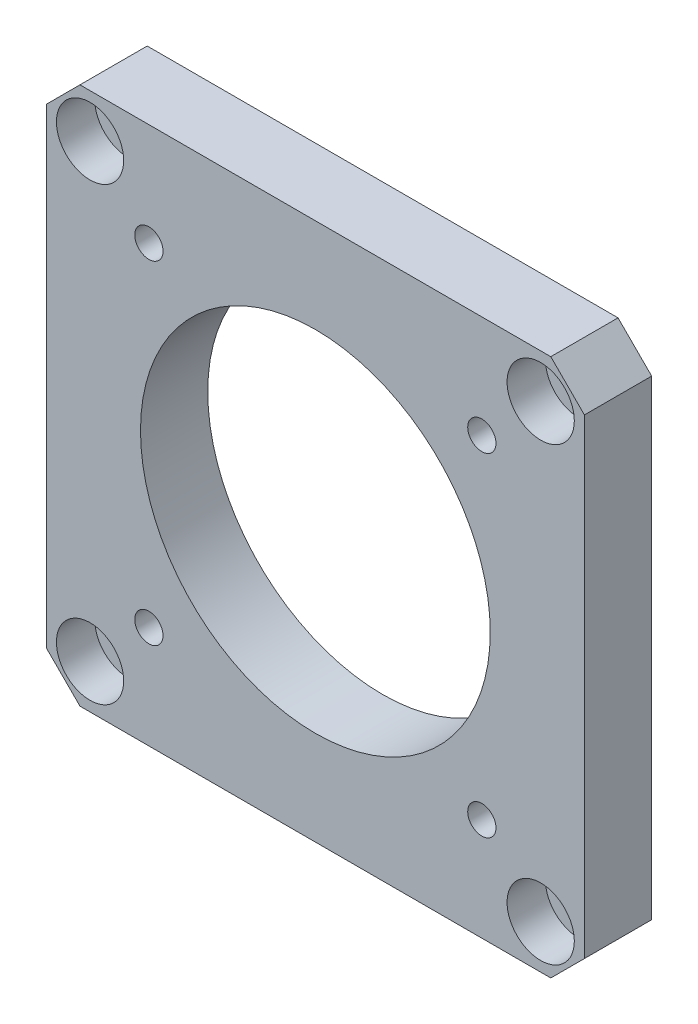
ISO-10303-21;
HEADER;
FILE_DESCRIPTION(('STEP AP214'),'2;1');
FILE_NAME('part.step','',(''),(''),'','','');
FILE_SCHEMA(('AUTOMOTIVE_DESIGN { 1 0 10303 214 1 1 1 1 }'));
ENDSEC;
DATA;
#1=APPLICATION_CONTEXT('core data for automotive mechanical design processes');
#2=APPLICATION_PROTOCOL_DEFINITION('international standard','automotive_design',2000,#1);
#3=PRODUCT_CONTEXT('',#1,'mechanical');
#4=PRODUCT('Part','Part','',(#3));
#5=PRODUCT_RELATED_PRODUCT_CATEGORY('part','',(#4));
#6=PRODUCT_DEFINITION_FORMATION('','',#4);
#7=PRODUCT_DEFINITION_CONTEXT('part definition',#1,'design');
#8=PRODUCT_DEFINITION('design','',#6,#7);
#9=PRODUCT_DEFINITION_SHAPE('','',#8);
#10=(LENGTH_UNIT() NAMED_UNIT(*) SI_UNIT(.MILLI.,.METRE.));
#11=(NAMED_UNIT(*) PLANE_ANGLE_UNIT() SI_UNIT($,.RADIAN.));
#12=(NAMED_UNIT(*) SI_UNIT($,.STERADIAN.) SOLID_ANGLE_UNIT());
#13=UNCERTAINTY_MEASURE_WITH_UNIT(LENGTH_MEASURE(1.E-05),#10,'distance_accuracy_value','');
#14=(GEOMETRIC_REPRESENTATION_CONTEXT(3) GLOBAL_UNCERTAINTY_ASSIGNED_CONTEXT((#13)) GLOBAL_UNIT_ASSIGNED_CONTEXT((#10,
#11,#12)) REPRESENTATION_CONTEXT('',''));
#15=CARTESIAN_POINT('',(0.,0.,0.));
#16=DIRECTION('',(0.,0.,1.));
#17=DIRECTION('',(1.,0.,0.));
#18=AXIS2_PLACEMENT_3D('',#15,#16,#17);
#19=CARTESIAN_POINT('',(-33.5,-33.5,10.));
#20=DIRECTION('',(0.,0.,1.));
#21=DIRECTION('',(1.,0.,0.));
#22=AXIS2_PLACEMENT_3D('',#19,#20,#21);
#23=CYLINDRICAL_SURFACE('',#22,2.75);
#24=CARTESIAN_POINT('',(-33.5,-33.5,4.3));
#25=DIRECTION('',(0.,0.,1.));
#26=DIRECTION('',(1.,0.,0.));
#27=AXIS2_PLACEMENT_3D('',#24,#25,#26);
#28=CIRCLE('',#27,2.75);
#29=CARTESIAN_POINT('',(-30.75,-33.5,4.3));
#30=VERTEX_POINT('',#29);
#31=EDGE_CURVE('E201',#30,#30,#28,.T.);
#32=ORIENTED_EDGE('',*,*,#31,.T.);
#33=EDGE_LOOP('',(#32));
#34=FACE_BOUND('',#33,.T.);
#35=CARTESIAN_POINT('',(-33.5,-33.5,1.));
#36=DIRECTION('',(0.,0.,-1.));
#37=DIRECTION('',(-1.,0.,0.));
#38=AXIS2_PLACEMENT_3D('',#35,#36,#37);
#39=CIRCLE('',#38,2.75);
#40=CARTESIAN_POINT('',(-36.25,-33.5,1.));
#41=VERTEX_POINT('',#40);
#42=EDGE_CURVE('E20',#41,#41,#39,.F.);
#43=ORIENTED_EDGE('',*,*,#42,.F.);
#44=EDGE_LOOP('',(#43));
#45=FACE_BOUND('',#44,.T.);
#46=ADVANCED_FACE('F16',(#34,#45),#23,.F.);
#47=CARTESIAN_POINT('',(33.5,-33.5,10.));
#48=DIRECTION('',(0.,0.,1.));
#49=DIRECTION('',(1.,0.,0.));
#50=AXIS2_PLACEMENT_3D('',#47,#48,#49);
#51=CYLINDRICAL_SURFACE('',#50,2.75);
#52=CARTESIAN_POINT('',(33.5,-33.5,4.3));
#53=DIRECTION('',(0.,0.,1.));
#54=DIRECTION('',(1.,0.,0.));
#55=AXIS2_PLACEMENT_3D('',#52,#53,#54);
#56=CIRCLE('',#55,2.75);
#57=CARTESIAN_POINT('',(36.25,-33.5,4.3));
#58=VERTEX_POINT('',#57);
#59=EDGE_CURVE('E210',#58,#58,#56,.T.);
#60=ORIENTED_EDGE('',*,*,#59,.T.);
#61=EDGE_LOOP('',(#60));
#62=FACE_BOUND('',#61,.T.);
#63=CARTESIAN_POINT('',(33.5,-33.5,1.));
#64=DIRECTION('',(0.,0.,-1.));
#65=DIRECTION('',(-1.,0.,0.));
#66=AXIS2_PLACEMENT_3D('',#63,#64,#65);
#67=CIRCLE('',#66,2.75);
#68=CARTESIAN_POINT('',(30.75,-33.5,1.));
#69=VERTEX_POINT('',#68);
#70=EDGE_CURVE('E153',#69,#69,#67,.F.);
#71=ORIENTED_EDGE('',*,*,#70,.F.);
#72=EDGE_LOOP('',(#71));
#73=FACE_BOUND('',#72,.T.);
#74=ADVANCED_FACE('F278',(#62,#73),#51,.F.);
#75=CARTESIAN_POINT('',(-33.5,33.5,10.));
#76=DIRECTION('',(0.,0.,1.));
#77=DIRECTION('',(1.,0.,0.));
#78=AXIS2_PLACEMENT_3D('',#75,#76,#77);
#79=CYLINDRICAL_SURFACE('',#78,2.75);
#80=CARTESIAN_POINT('',(-33.5,33.5,4.3));
#81=DIRECTION('',(0.,0.,1.));
#82=DIRECTION('',(1.,0.,0.));
#83=AXIS2_PLACEMENT_3D('',#80,#81,#82);
#84=CIRCLE('',#83,2.75);
#85=CARTESIAN_POINT('',(-30.75,33.5,4.3));
#86=VERTEX_POINT('',#85);
#87=EDGE_CURVE('E192',#86,#86,#84,.T.);
#88=ORIENTED_EDGE('',*,*,#87,.T.);
#89=EDGE_LOOP('',(#88));
#90=FACE_BOUND('',#89,.T.);
#91=CARTESIAN_POINT('',(-33.5,33.5,1.));
#92=DIRECTION('',(0.,0.,-1.));
#93=DIRECTION('',(-1.,0.,0.));
#94=AXIS2_PLACEMENT_3D('',#91,#92,#93);
#95=CIRCLE('',#94,2.75);
#96=CARTESIAN_POINT('',(-36.25,33.5,1.));
#97=VERTEX_POINT('',#96);
#98=EDGE_CURVE('E149',#97,#97,#95,.F.);
#99=ORIENTED_EDGE('',*,*,#98,.F.);
#100=EDGE_LOOP('',(#99));
#101=FACE_BOUND('',#100,.T.);
#102=ADVANCED_FACE('F285',(#90,#101),#79,.F.);
#103=CARTESIAN_POINT('',(33.5,33.5,10.));
#104=DIRECTION('',(0.,0.,1.));
#105=DIRECTION('',(1.,0.,0.));
#106=AXIS2_PLACEMENT_3D('',#103,#104,#105);
#107=CYLINDRICAL_SURFACE('',#106,2.75);
#108=CARTESIAN_POINT('',(33.5,33.5,4.3));
#109=DIRECTION('',(0.,0.,1.));
#110=DIRECTION('',(1.,0.,0.));
#111=AXIS2_PLACEMENT_3D('',#108,#109,#110);
#112=CIRCLE('',#111,2.75);
#113=CARTESIAN_POINT('',(36.25,33.5,4.3));
#114=VERTEX_POINT('',#113);
#115=EDGE_CURVE('E183',#114,#114,#112,.T.);
#116=ORIENTED_EDGE('',*,*,#115,.T.);
#117=EDGE_LOOP('',(#116));
#118=FACE_BOUND('',#117,.T.);
#119=CARTESIAN_POINT('',(33.5,33.5,1.));
#120=DIRECTION('',(0.,0.,-1.));
#121=DIRECTION('',(-1.,0.,0.));
#122=AXIS2_PLACEMENT_3D('',#119,#120,#121);
#123=CIRCLE('',#122,2.75);
#124=CARTESIAN_POINT('',(30.75,33.5,1.));
#125=VERTEX_POINT('',#124);
#126=EDGE_CURVE('E144',#125,#125,#123,.F.);
#127=ORIENTED_EDGE('',*,*,#126,.F.);
#128=EDGE_LOOP('',(#127));
#129=FACE_BOUND('',#128,.T.);
#130=ADVANCED_FACE('F335',(#118,#129),#107,.F.);
#131=CARTESIAN_POINT('',(-40.,40.,10.));
#132=DIRECTION('',(1.,0.,0.));
#133=DIRECTION('',(0.,1.,0.));
#134=AXIS2_PLACEMENT_3D('',#131,#132,#133);
#135=PLANE('',#134);
#136=DIRECTION('',(0.,-1.,0.));
#137=VECTOR('',#136,1.);
#138=CARTESIAN_POINT('',(-40.,40.,0.));
#139=LINE('',#138,#137);
#140=CARTESIAN_POINT('',(-40.,35.,0.));
#141=VERTEX_POINT('',#140);
#142=CARTESIAN_POINT('',(-40.,-35.,0.));
#143=VERTEX_POINT('',#142);
#144=EDGE_CURVE('E111',#141,#143,#139,.T.);
#145=ORIENTED_EDGE('',*,*,#144,.T.);
#146=DIRECTION('',(0.,0.,1.));
#147=VECTOR('',#146,1.);
#148=CARTESIAN_POINT('',(-40.,-35.,10.));
#149=LINE('',#148,#147);
#150=CARTESIAN_POINT('',(-40.,-35.,10.));
#151=VERTEX_POINT('',#150);
#152=EDGE_CURVE('E89',#143,#151,#149,.T.);
#153=ORIENTED_EDGE('',*,*,#152,.T.);
#154=DIRECTION('',(0.,-1.,0.));
#155=VECTOR('',#154,1.);
#156=CARTESIAN_POINT('',(-40.,40.,10.));
#157=LINE('',#156,#155);
#158=CARTESIAN_POINT('',(-40.,35.,10.));
#159=VERTEX_POINT('',#158);
#160=EDGE_CURVE('E121',#159,#151,#157,.T.);
#161=ORIENTED_EDGE('',*,*,#160,.F.);
#162=DIRECTION('',(0.,0.,-1.));
#163=VECTOR('',#162,1.);
#164=CARTESIAN_POINT('',(-40.,35.,10.));
#165=LINE('',#164,#163);
#166=EDGE_CURVE('E94',#159,#141,#165,.T.);
#167=ORIENTED_EDGE('',*,*,#166,.T.);
#168=EDGE_LOOP('',(#145,#153,#161,#167));
#169=FACE_BOUND('',#168,.T.);
#170=ADVANCED_FACE('F254',(#169),#135,.F.);
#171=CARTESIAN_POINT('',(40.,-40.,10.));
#172=DIRECTION('',(0.,1.,0.));
#173=DIRECTION('',(-1.,0.,0.));
#174=AXIS2_PLACEMENT_3D('',#171,#172,#173);
#175=PLANE('',#174);
#176=DIRECTION('',(1.,0.,0.));
#177=VECTOR('',#176,1.);
#178=CARTESIAN_POINT('',(40.,-40.,10.));
#179=LINE('',#178,#177);
#180=CARTESIAN_POINT('',(-35.,-40.,10.));
#181=VERTEX_POINT('',#180);
#182=CARTESIAN_POINT('',(35.,-40.,10.));
#183=VERTEX_POINT('',#182);
#184=EDGE_CURVE('E104',#181,#183,#179,.T.);
#185=ORIENTED_EDGE('',*,*,#184,.F.);
#186=DIRECTION('',(0.,0.,-1.));
#187=VECTOR('',#186,1.);
#188=CARTESIAN_POINT('',(-35.,-40.,10.));
#189=LINE('',#188,#187);
#190=CARTESIAN_POINT('',(-35.,-40.,0.));
#191=VERTEX_POINT('',#190);
#192=EDGE_CURVE('E88',#181,#191,#189,.T.);
#193=ORIENTED_EDGE('',*,*,#192,.T.);
#194=DIRECTION('',(1.,0.,0.));
#195=VECTOR('',#194,1.);
#196=CARTESIAN_POINT('',(40.,-40.,0.));
#197=LINE('',#196,#195);
#198=CARTESIAN_POINT('',(35.,-40.,0.));
#199=VERTEX_POINT('',#198);
#200=EDGE_CURVE('E101',#191,#199,#197,.T.);
#201=ORIENTED_EDGE('',*,*,#200,.T.);
#202=DIRECTION('',(0.,0.,1.));
#203=VECTOR('',#202,1.);
#204=CARTESIAN_POINT('',(35.,-40.,10.));
#205=LINE('',#204,#203);
#206=EDGE_CURVE('E106',#199,#183,#205,.T.);
#207=ORIENTED_EDGE('',*,*,#206,.T.);
#208=EDGE_LOOP('',(#185,#193,#201,#207));
#209=FACE_BOUND('',#208,.T.);
#210=ADVANCED_FACE('F100',(#209),#175,.F.);
#211=CARTESIAN_POINT('',(40.,40.,10.));
#212=DIRECTION('',(-1.,0.,0.));
#213=DIRECTION('',(0.,-1.,0.));
#214=AXIS2_PLACEMENT_3D('',#211,#212,#213);
#215=PLANE('',#214);
#216=DIRECTION('',(0.,1.,0.));
#217=VECTOR('',#216,1.);
#218=CARTESIAN_POINT('',(40.,40.,0.));
#219=LINE('',#218,#217);
#220=CARTESIAN_POINT('',(40.,-35.,0.));
#221=VERTEX_POINT('',#220);
#222=CARTESIAN_POINT('',(40.,35.,0.));
#223=VERTEX_POINT('',#222);
#224=EDGE_CURVE('E110',#221,#223,#219,.T.);
#225=ORIENTED_EDGE('',*,*,#224,.T.);
#226=DIRECTION('',(0.,0.,1.));
#227=VECTOR('',#226,1.);
#228=CARTESIAN_POINT('',(40.,35.,10.));
#229=LINE('',#228,#227);
#230=CARTESIAN_POINT('',(40.,35.,10.));
#231=VERTEX_POINT('',#230);
#232=EDGE_CURVE('E11',#223,#231,#229,.T.);
#233=ORIENTED_EDGE('',*,*,#232,.T.);
#234=DIRECTION('',(0.,1.,0.));
#235=VECTOR('',#234,1.);
#236=CARTESIAN_POINT('',(40.,40.,10.));
#237=LINE('',#236,#235);
#238=CARTESIAN_POINT('',(40.,-35.,10.));
#239=VERTEX_POINT('',#238);
#240=EDGE_CURVE('E245',#239,#231,#237,.T.);
#241=ORIENTED_EDGE('',*,*,#240,.F.);
#242=DIRECTION('',(0.,0.,-1.));
#243=VECTOR('',#242,1.);
#244=CARTESIAN_POINT('',(40.,-35.,10.));
#245=LINE('',#244,#243);
#246=EDGE_CURVE('E25',#239,#221,#245,.T.);
#247=ORIENTED_EDGE('',*,*,#246,.T.);
#248=EDGE_LOOP('',(#225,#233,#241,#247));
#249=FACE_BOUND('',#248,.T.);
#250=ADVANCED_FACE('F261',(#249),#215,.F.);
#251=CARTESIAN_POINT('',(40.,40.,10.));
#252=DIRECTION('',(0.,-1.,0.));
#253=DIRECTION('',(1.,0.,0.));
#254=AXIS2_PLACEMENT_3D('',#251,#252,#253);
#255=PLANE('',#254);
#256=DIRECTION('',(-1.,0.,0.));
#257=VECTOR('',#256,1.);
#258=CARTESIAN_POINT('',(40.,40.,0.));
#259=LINE('',#258,#257);
#260=CARTESIAN_POINT('',(35.,40.,0.));
#261=VERTEX_POINT('',#260);
#262=CARTESIAN_POINT('',(-35.,40.,0.));
#263=VERTEX_POINT('',#262);
#264=EDGE_CURVE('E114',#261,#263,#259,.T.);
#265=ORIENTED_EDGE('',*,*,#264,.T.);
#266=DIRECTION('',(0.,0.,1.));
#267=VECTOR('',#266,1.);
#268=CARTESIAN_POINT('',(-35.,40.,10.));
#269=LINE('',#268,#267);
#270=CARTESIAN_POINT('',(-35.,40.,10.));
#271=VERTEX_POINT('',#270);
#272=EDGE_CURVE('E33',#263,#271,#269,.T.);
#273=ORIENTED_EDGE('',*,*,#272,.T.);
#274=DIRECTION('',(-1.,0.,0.));
#275=VECTOR('',#274,1.);
#276=CARTESIAN_POINT('',(40.,40.,10.));
#277=LINE('',#276,#275);
#278=CARTESIAN_POINT('',(35.,40.,10.));
#279=VERTEX_POINT('',#278);
#280=EDGE_CURVE('E122',#279,#271,#277,.T.);
#281=ORIENTED_EDGE('',*,*,#280,.F.);
#282=DIRECTION('',(0.,0.,-1.));
#283=VECTOR('',#282,1.);
#284=CARTESIAN_POINT('',(35.,40.,10.));
#285=LINE('',#284,#283);
#286=EDGE_CURVE('E138',#279,#261,#285,.T.);
#287=ORIENTED_EDGE('',*,*,#286,.T.);
#288=EDGE_LOOP('',(#265,#273,#281,#287));
#289=FACE_BOUND('',#288,.T.);
#290=ADVANCED_FACE('F256',(#289),#255,.F.);
#291=CARTESIAN_POINT('',(0.,0.,10.));
#292=DIRECTION('',(0.,0.,-1.));
#293=DIRECTION('',(-1.,0.,0.));
#294=AXIS2_PLACEMENT_3D('',#291,#292,#293);
#295=PLANE('',#294);
#296=CARTESIAN_POINT('',(33.5,33.5,10.));
#297=DIRECTION('',(0.,0.,1.));
#298=DIRECTION('',(1.,0.,0.));
#299=AXIS2_PLACEMENT_3D('',#296,#297,#298);
#300=CIRCLE('',#299,5.);
#301=CARTESIAN_POINT('',(38.5,33.5,10.));
#302=VERTEX_POINT('',#301);
#303=EDGE_CURVE('E147',#302,#302,#300,.T.);
#304=ORIENTED_EDGE('',*,*,#303,.F.);
#305=EDGE_LOOP('',(#304));
#306=FACE_BOUND('',#305,.T.);
#307=CARTESIAN_POINT('',(-33.5,33.5,10.));
#308=DIRECTION('',(0.,0.,1.));
#309=DIRECTION('',(1.,0.,0.));
#310=AXIS2_PLACEMENT_3D('',#307,#308,#309);
#311=CIRCLE('',#310,5.);
#312=CARTESIAN_POINT('',(-28.5,33.5,10.));
#313=VERTEX_POINT('',#312);
#314=EDGE_CURVE('E186',#313,#313,#311,.T.);
#315=ORIENTED_EDGE('',*,*,#314,.F.);
#316=EDGE_LOOP('',(#315));
#317=FACE_BOUND('',#316,.T.);
#318=CARTESIAN_POINT('',(-33.5,-33.5,10.));
#319=DIRECTION('',(0.,0.,1.));
#320=DIRECTION('',(1.,0.,0.));
#321=AXIS2_PLACEMENT_3D('',#318,#319,#320);
#322=CIRCLE('',#321,5.);
#323=CARTESIAN_POINT('',(-28.5,-33.5,10.));
#324=VERTEX_POINT('',#323);
#325=EDGE_CURVE('E195',#324,#324,#322,.T.);
#326=ORIENTED_EDGE('',*,*,#325,.F.);
#327=EDGE_LOOP('',(#326));
#328=FACE_BOUND('',#327,.T.);
#329=CARTESIAN_POINT('',(33.5,-33.5,10.));
#330=DIRECTION('',(0.,0.,1.));
#331=DIRECTION('',(1.,0.,0.));
#332=AXIS2_PLACEMENT_3D('',#329,#330,#331);
#333=CIRCLE('',#332,5.);
#334=CARTESIAN_POINT('',(38.5,-33.5,10.));
#335=VERTEX_POINT('',#334);
#336=EDGE_CURVE('E204',#335,#335,#333,.T.);
#337=ORIENTED_EDGE('',*,*,#336,.F.);
#338=EDGE_LOOP('',(#337));
#339=FACE_BOUND('',#338,.T.);
#340=CARTESIAN_POINT('',(24.7487373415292,24.7487373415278,10.));
#341=DIRECTION('',(0.,0.,-1.));
#342=DIRECTION('',(-1.,0.,0.));
#343=AXIS2_PLACEMENT_3D('',#340,#341,#342);
#344=CIRCLE('',#343,2.1);
#345=CARTESIAN_POINT('',(22.6487373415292,24.7487373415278,10.));
#346=VERTEX_POINT('',#345);
#347=EDGE_CURVE('E216',#346,#346,#344,.T.);
#348=ORIENTED_EDGE('',*,*,#347,.T.);
#349=EDGE_LOOP('',(#348));
#350=FACE_BOUND('',#349,.T.);
#351=CARTESIAN_POINT('',(-24.7487373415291,24.7487373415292,10.));
#352=DIRECTION('',(0.,0.,-1.));
#353=DIRECTION('',(-1.,0.,0.));
#354=AXIS2_PLACEMENT_3D('',#351,#352,#353);
#355=CIRCLE('',#354,2.1);
#356=CARTESIAN_POINT('',(-26.8487373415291,24.7487373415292,10.));
#357=VERTEX_POINT('',#356);
#358=EDGE_CURVE('E222',#357,#357,#355,.T.);
#359=ORIENTED_EDGE('',*,*,#358,.T.);
#360=EDGE_LOOP('',(#359));
#361=FACE_BOUND('',#360,.T.);
#362=CARTESIAN_POINT('',(-24.7487373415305,-24.7487373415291,10.));
#363=DIRECTION('',(0.,0.,-1.));
#364=DIRECTION('',(-1.,0.,0.));
#365=AXIS2_PLACEMENT_3D('',#362,#363,#364);
#366=CIRCLE('',#365,2.1);
#367=CARTESIAN_POINT('',(-26.8487373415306,-24.7487373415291,10.));
#368=VERTEX_POINT('',#367);
#369=EDGE_CURVE('E228',#368,#368,#366,.T.);
#370=ORIENTED_EDGE('',*,*,#369,.T.);
#371=EDGE_LOOP('',(#370));
#372=FACE_BOUND('',#371,.T.);
#373=CARTESIAN_POINT('',(24.7487373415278,-24.7487373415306,10.));
#374=DIRECTION('',(0.,0.,-1.));
#375=DIRECTION('',(-1.,0.,0.));
#376=AXIS2_PLACEMENT_3D('',#373,#374,#375);
#377=CIRCLE('',#376,2.1);
#378=CARTESIAN_POINT('',(22.6487373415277,-24.7487373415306,10.));
#379=VERTEX_POINT('',#378);
#380=EDGE_CURVE('E234',#379,#379,#377,.T.);
#381=ORIENTED_EDGE('',*,*,#380,.T.);
#382=EDGE_LOOP('',(#381));
#383=FACE_BOUND('',#382,.T.);
#384=CARTESIAN_POINT('',(0.,0.,10.));
#385=DIRECTION('',(0.,0.,-1.));
#386=DIRECTION('',(-1.,0.,0.));
#387=AXIS2_PLACEMENT_3D('',#384,#385,#386);
#388=CIRCLE('',#387,26.);
#389=CARTESIAN_POINT('',(-26.,0.,10.));
#390=VERTEX_POINT('',#389);
#391=EDGE_CURVE('E116',#390,#390,#388,.T.);
#392=ORIENTED_EDGE('',*,*,#391,.T.);
#393=EDGE_LOOP('',(#392));
#394=FACE_BOUND('',#393,.T.);
#395=ORIENTED_EDGE('',*,*,#160,.T.);
#396=DIRECTION('',(-0.707106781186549,0.707106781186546,0.));
#397=VECTOR('',#396,1.);
#398=CARTESIAN_POINT('',(-35.,-40.,10.));
#399=LINE('',#398,#397);
#400=EDGE_CURVE('E136',#151,#181,#399,.F.);
#401=ORIENTED_EDGE('',*,*,#400,.T.);
#402=ORIENTED_EDGE('',*,*,#184,.T.);
#403=DIRECTION('',(-0.707106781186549,-0.707106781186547,0.));
#404=VECTOR('',#403,1.);
#405=CARTESIAN_POINT('',(40.,-35.,10.));
#406=LINE('',#405,#404);
#407=EDGE_CURVE('E131',#183,#239,#406,.F.);
#408=ORIENTED_EDGE('',*,*,#407,.T.);
#409=ORIENTED_EDGE('',*,*,#240,.T.);
#410=DIRECTION('',(0.707106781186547,-0.707106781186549,0.));
#411=VECTOR('',#410,1.);
#412=CARTESIAN_POINT('',(35.,40.,10.));
#413=LINE('',#412,#411);
#414=EDGE_CURVE('E40',#231,#279,#413,.F.);
#415=ORIENTED_EDGE('',*,*,#414,.T.);
#416=ORIENTED_EDGE('',*,*,#280,.T.);
#417=DIRECTION('',(0.707106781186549,0.707106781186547,0.));
#418=VECTOR('',#417,1.);
#419=CARTESIAN_POINT('',(-40.,35.,10.));
#420=LINE('',#419,#418);
#421=EDGE_CURVE('E134',#271,#159,#420,.F.);
#422=ORIENTED_EDGE('',*,*,#421,.T.);
#423=EDGE_LOOP('',(#395,#401,#402,#408,#409,#415,#416,#422));
#424=FACE_BOUND('',#423,.T.);
#425=ADVANCED_FACE('F247',(#306,#317,#328,#339,#350,#361,#372,#383,#394,#424),#295,.F.);
#426=CARTESIAN_POINT('',(0.,0.,0.));
#427=DIRECTION('',(0.,0.,-1.));
#428=DIRECTION('',(-1.,0.,0.));
#429=AXIS2_PLACEMENT_3D('',#426,#427,#428);
#430=PLANE('',#429);
#431=CARTESIAN_POINT('',(-33.5,-33.5,0.));
#432=DIRECTION('',(0.,0.,-1.));
#433=DIRECTION('',(-1.,0.,0.));
#434=AXIS2_PLACEMENT_3D('',#431,#432,#433);
#435=CIRCLE('',#434,5.);
#436=CARTESIAN_POINT('',(-38.5,-33.5,0.));
#437=VERTEX_POINT('',#436);
#438=EDGE_CURVE('E169',#437,#437,#435,.T.);
#439=ORIENTED_EDGE('',*,*,#438,.F.);
#440=EDGE_LOOP('',(#439));
#441=FACE_BOUND('',#440,.T.);
#442=CARTESIAN_POINT('',(33.5,-33.5,0.));
#443=DIRECTION('',(0.,0.,-1.));
#444=DIRECTION('',(-1.,0.,0.));
#445=AXIS2_PLACEMENT_3D('',#442,#443,#444);
#446=CIRCLE('',#445,5.);
#447=CARTESIAN_POINT('',(28.5,-33.5,0.));
#448=VERTEX_POINT('',#447);
#449=EDGE_CURVE('E162',#448,#448,#446,.T.);
#450=ORIENTED_EDGE('',*,*,#449,.F.);
#451=EDGE_LOOP('',(#450));
#452=FACE_BOUND('',#451,.T.);
#453=CARTESIAN_POINT('',(-33.5,33.5,0.));
#454=DIRECTION('',(0.,0.,-1.));
#455=DIRECTION('',(-1.,0.,0.));
#456=AXIS2_PLACEMENT_3D('',#453,#454,#455);
#457=CIRCLE('',#456,5.);
#458=CARTESIAN_POINT('',(-38.5,33.5,0.));
#459=VERTEX_POINT('',#458);
#460=EDGE_CURVE('E155',#459,#459,#457,.T.);
#461=ORIENTED_EDGE('',*,*,#460,.F.);
#462=EDGE_LOOP('',(#461));
#463=FACE_BOUND('',#462,.T.);
#464=CARTESIAN_POINT('',(33.5,33.5,0.));
#465=DIRECTION('',(0.,0.,-1.));
#466=DIRECTION('',(-1.,0.,0.));
#467=AXIS2_PLACEMENT_3D('',#464,#465,#466);
#468=CIRCLE('',#467,5.);
#469=CARTESIAN_POINT('',(28.5,33.5,0.));
#470=VERTEX_POINT('',#469);
#471=EDGE_CURVE('E151',#470,#470,#468,.T.);
#472=ORIENTED_EDGE('',*,*,#471,.F.);
#473=EDGE_LOOP('',(#472));
#474=FACE_BOUND('',#473,.T.);
#475=CARTESIAN_POINT('',(24.7487373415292,24.7487373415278,0.));
#476=DIRECTION('',(0.,0.,-1.));
#477=DIRECTION('',(-1.,0.,0.));
#478=AXIS2_PLACEMENT_3D('',#475,#476,#477);
#479=CIRCLE('',#478,2.1);
#480=CARTESIAN_POINT('',(22.6487373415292,24.7487373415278,0.));
#481=VERTEX_POINT('',#480);
#482=EDGE_CURVE('E213',#481,#481,#479,.T.);
#483=ORIENTED_EDGE('',*,*,#482,.F.);
#484=EDGE_LOOP('',(#483));
#485=FACE_BOUND('',#484,.T.);
#486=CARTESIAN_POINT('',(-24.7487373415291,24.7487373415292,0.));
#487=DIRECTION('',(0.,0.,-1.));
#488=DIRECTION('',(-1.,0.,0.));
#489=AXIS2_PLACEMENT_3D('',#486,#487,#488);
#490=CIRCLE('',#489,2.1);
#491=CARTESIAN_POINT('',(-26.8487373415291,24.7487373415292,0.));
#492=VERTEX_POINT('',#491);
#493=EDGE_CURVE('E219',#492,#492,#490,.T.);
#494=ORIENTED_EDGE('',*,*,#493,.F.);
#495=EDGE_LOOP('',(#494));
#496=FACE_BOUND('',#495,.T.);
#497=CARTESIAN_POINT('',(-24.7487373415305,-24.7487373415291,0.));
#498=DIRECTION('',(0.,0.,-1.));
#499=DIRECTION('',(-1.,0.,0.));
#500=AXIS2_PLACEMENT_3D('',#497,#498,#499);
#501=CIRCLE('',#500,2.1);
#502=CARTESIAN_POINT('',(-26.8487373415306,-24.7487373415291,0.));
#503=VERTEX_POINT('',#502);
#504=EDGE_CURVE('E225',#503,#503,#501,.T.);
#505=ORIENTED_EDGE('',*,*,#504,.F.);
#506=EDGE_LOOP('',(#505));
#507=FACE_BOUND('',#506,.T.);
#508=CARTESIAN_POINT('',(24.7487373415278,-24.7487373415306,0.));
#509=DIRECTION('',(0.,0.,-1.));
#510=DIRECTION('',(-1.,0.,0.));
#511=AXIS2_PLACEMENT_3D('',#508,#509,#510);
#512=CIRCLE('',#511,2.1);
#513=CARTESIAN_POINT('',(22.6487373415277,-24.7487373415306,0.));
#514=VERTEX_POINT('',#513);
#515=EDGE_CURVE('E231',#514,#514,#512,.T.);
#516=ORIENTED_EDGE('',*,*,#515,.F.);
#517=EDGE_LOOP('',(#516));
#518=FACE_BOUND('',#517,.T.);
#519=CARTESIAN_POINT('',(0.,0.,0.));
#520=DIRECTION('',(0.,0.,-1.));
#521=DIRECTION('',(-1.,0.,0.));
#522=AXIS2_PLACEMENT_3D('',#519,#520,#521);
#523=CIRCLE('',#522,26.);
#524=CARTESIAN_POINT('',(-26.,0.,0.));
#525=VERTEX_POINT('',#524);
#526=EDGE_CURVE('E237',#525,#525,#523,.T.);
#527=ORIENTED_EDGE('',*,*,#526,.F.);
#528=EDGE_LOOP('',(#527));
#529=FACE_BOUND('',#528,.T.);
#530=ORIENTED_EDGE('',*,*,#200,.F.);
#531=DIRECTION('',(0.707106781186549,-0.707106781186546,0.));
#532=VECTOR('',#531,1.);
#533=CARTESIAN_POINT('',(-37.5,-37.5,0.));
#534=LINE('',#533,#532);
#535=EDGE_CURVE('E84',#191,#143,#534,.F.);
#536=ORIENTED_EDGE('',*,*,#535,.T.);
#537=ORIENTED_EDGE('',*,*,#144,.F.);
#538=DIRECTION('',(-0.707106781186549,-0.707106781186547,0.));
#539=VECTOR('',#538,1.);
#540=CARTESIAN_POINT('',(-37.5,37.5,0.));
#541=LINE('',#540,#539);
#542=EDGE_CURVE('E95',#141,#263,#541,.F.);
#543=ORIENTED_EDGE('',*,*,#542,.T.);
#544=ORIENTED_EDGE('',*,*,#264,.F.);
#545=DIRECTION('',(-0.707106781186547,0.707106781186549,0.));
#546=VECTOR('',#545,1.);
#547=CARTESIAN_POINT('',(37.5,37.5,0.));
#548=LINE('',#547,#546);
#549=EDGE_CURVE('E125',#261,#223,#548,.F.);
#550=ORIENTED_EDGE('',*,*,#549,.T.);
#551=ORIENTED_EDGE('',*,*,#224,.F.);
#552=DIRECTION('',(0.707106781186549,0.707106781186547,0.));
#553=VECTOR('',#552,1.);
#554=CARTESIAN_POINT('',(37.5,-37.5,0.));
#555=LINE('',#554,#553);
#556=EDGE_CURVE('E105',#221,#199,#555,.F.);
#557=ORIENTED_EDGE('',*,*,#556,.T.);
#558=EDGE_LOOP('',(#530,#536,#537,#543,#544,#550,#551,#557));
#559=FACE_BOUND('',#558,.T.);
#560=ADVANCED_FACE('F108',(#441,#452,#463,#474,#485,#496,#507,#518,#529,#559),#430,.T.);
#561=CARTESIAN_POINT('',(0.,0.,10.));
#562=DIRECTION('',(0.,0.,-1.));
#563=DIRECTION('',(-1.,0.,0.));
#564=AXIS2_PLACEMENT_3D('',#561,#562,#563);
#565=CYLINDRICAL_SURFACE('',#564,26.);
#566=ORIENTED_EDGE('',*,*,#391,.F.);
#567=EDGE_LOOP('',(#566));
#568=FACE_BOUND('',#567,.T.);
#569=ORIENTED_EDGE('',*,*,#526,.T.);
#570=EDGE_LOOP('',(#569));
#571=FACE_BOUND('',#570,.T.);
#572=ADVANCED_FACE('F316',(#568,#571),#565,.F.);
#573=CARTESIAN_POINT('',(24.7487373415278,-24.7487373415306,0.));
#574=DIRECTION('',(0.,0.,-1.));
#575=DIRECTION('',(-1.,0.,0.));
#576=AXIS2_PLACEMENT_3D('',#573,#574,#575);
#577=CYLINDRICAL_SURFACE('',#576,2.1);
#578=ORIENTED_EDGE('',*,*,#380,.F.);
#579=EDGE_LOOP('',(#578));
#580=FACE_BOUND('',#579,.T.);
#581=ORIENTED_EDGE('',*,*,#515,.T.);
#582=EDGE_LOOP('',(#581));
#583=FACE_BOUND('',#582,.T.);
#584=ADVANCED_FACE('F312',(#580,#583),#577,.F.);
#585=CARTESIAN_POINT('',(-24.7487373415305,-24.7487373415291,0.));
#586=DIRECTION('',(0.,0.,-1.));
#587=DIRECTION('',(-1.,0.,0.));
#588=AXIS2_PLACEMENT_3D('',#585,#586,#587);
#589=CYLINDRICAL_SURFACE('',#588,2.1);
#590=ORIENTED_EDGE('',*,*,#369,.F.);
#591=EDGE_LOOP('',(#590));
#592=FACE_BOUND('',#591,.T.);
#593=ORIENTED_EDGE('',*,*,#504,.T.);
#594=EDGE_LOOP('',(#593));
#595=FACE_BOUND('',#594,.T.);
#596=ADVANCED_FACE('F308',(#592,#595),#589,.F.);
#597=CARTESIAN_POINT('',(-24.7487373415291,24.7487373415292,0.));
#598=DIRECTION('',(0.,0.,-1.));
#599=DIRECTION('',(-1.,0.,0.));
#600=AXIS2_PLACEMENT_3D('',#597,#598,#599);
#601=CYLINDRICAL_SURFACE('',#600,2.1);
#602=ORIENTED_EDGE('',*,*,#358,.F.);
#603=EDGE_LOOP('',(#602));
#604=FACE_BOUND('',#603,.T.);
#605=ORIENTED_EDGE('',*,*,#493,.T.);
#606=EDGE_LOOP('',(#605));
#607=FACE_BOUND('',#606,.T.);
#608=ADVANCED_FACE('F304',(#604,#607),#601,.F.);
#609=CARTESIAN_POINT('',(24.7487373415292,24.7487373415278,0.));
#610=DIRECTION('',(0.,0.,-1.));
#611=DIRECTION('',(-1.,0.,0.));
#612=AXIS2_PLACEMENT_3D('',#609,#610,#611);
#613=CYLINDRICAL_SURFACE('',#612,2.1);
#614=ORIENTED_EDGE('',*,*,#347,.F.);
#615=EDGE_LOOP('',(#614));
#616=FACE_BOUND('',#615,.T.);
#617=ORIENTED_EDGE('',*,*,#482,.T.);
#618=EDGE_LOOP('',(#617));
#619=FACE_BOUND('',#618,.T.);
#620=ADVANCED_FACE('F299',(#616,#619),#613,.F.);
#621=CARTESIAN_POINT('',(36.25,-33.5,4.3));
#622=DIRECTION('',(0.,0.,-1.));
#623=DIRECTION('',(-1.,0.,0.));
#624=AXIS2_PLACEMENT_3D('',#621,#622,#623);
#625=PLANE('',#624);
#626=ORIENTED_EDGE('',*,*,#59,.F.);
#627=EDGE_LOOP('',(#626));
#628=FACE_BOUND('',#627,.T.);
#629=CARTESIAN_POINT('',(33.5,-33.5,4.3));
#630=DIRECTION('',(0.,0.,1.));
#631=DIRECTION('',(1.,0.,0.));
#632=AXIS2_PLACEMENT_3D('',#629,#630,#631);
#633=CIRCLE('',#632,5.);
#634=CARTESIAN_POINT('',(38.5,-33.5,4.3));
#635=VERTEX_POINT('',#634);
#636=EDGE_CURVE('E207',#635,#635,#633,.T.);
#637=ORIENTED_EDGE('',*,*,#636,.T.);
#638=EDGE_LOOP('',(#637));
#639=FACE_BOUND('',#638,.T.);
#640=ADVANCED_FACE('F296',(#628,#639),#625,.F.);
#641=CARTESIAN_POINT('',(33.5,-33.5,10.));
#642=DIRECTION('',(0.,0.,1.));
#643=DIRECTION('',(1.,0.,0.));
#644=AXIS2_PLACEMENT_3D('',#641,#642,#643);
#645=CYLINDRICAL_SURFACE('',#644,5.);
#646=ORIENTED_EDGE('',*,*,#636,.F.);
#647=EDGE_LOOP('',(#646));
#648=FACE_BOUND('',#647,.T.);
#649=ORIENTED_EDGE('',*,*,#336,.T.);
#650=EDGE_LOOP('',(#649));
#651=FACE_BOUND('',#650,.T.);
#652=ADVANCED_FACE('F293',(#648,#651),#645,.F.);
#653=CARTESIAN_POINT('',(-30.75,-33.5,4.3));
#654=DIRECTION('',(0.,0.,-1.));
#655=DIRECTION('',(-1.,0.,0.));
#656=AXIS2_PLACEMENT_3D('',#653,#654,#655);
#657=PLANE('',#656);
#658=ORIENTED_EDGE('',*,*,#31,.F.);
#659=EDGE_LOOP('',(#658));
#660=FACE_BOUND('',#659,.T.);
#661=CARTESIAN_POINT('',(-33.5,-33.5,4.3));
#662=DIRECTION('',(0.,0.,1.));
#663=DIRECTION('',(1.,0.,0.));
#664=AXIS2_PLACEMENT_3D('',#661,#662,#663);
#665=CIRCLE('',#664,5.);
#666=CARTESIAN_POINT('',(-28.5,-33.5,4.3));
#667=VERTEX_POINT('',#666);
#668=EDGE_CURVE('E198',#667,#667,#665,.T.);
#669=ORIENTED_EDGE('',*,*,#668,.T.);
#670=EDGE_LOOP('',(#669));
#671=FACE_BOUND('',#670,.T.);
#672=ADVANCED_FACE('F291',(#660,#671),#657,.F.);
#673=CARTESIAN_POINT('',(-33.5,-33.5,10.));
#674=DIRECTION('',(0.,0.,1.));
#675=DIRECTION('',(1.,0.,0.));
#676=AXIS2_PLACEMENT_3D('',#673,#674,#675);
#677=CYLINDRICAL_SURFACE('',#676,5.);
#678=ORIENTED_EDGE('',*,*,#668,.F.);
#679=EDGE_LOOP('',(#678));
#680=FACE_BOUND('',#679,.T.);
#681=ORIENTED_EDGE('',*,*,#325,.T.);
#682=EDGE_LOOP('',(#681));
#683=FACE_BOUND('',#682,.T.);
#684=ADVANCED_FACE('F469',(#680,#683),#677,.F.);
#685=CARTESIAN_POINT('',(-30.75,33.5,4.3));
#686=DIRECTION('',(0.,0.,-1.));
#687=DIRECTION('',(-1.,0.,0.));
#688=AXIS2_PLACEMENT_3D('',#685,#686,#687);
#689=PLANE('',#688);
#690=ORIENTED_EDGE('',*,*,#87,.F.);
#691=EDGE_LOOP('',(#690));
#692=FACE_BOUND('',#691,.T.);
#693=CARTESIAN_POINT('',(-33.5,33.5,4.3));
#694=DIRECTION('',(0.,0.,1.));
#695=DIRECTION('',(1.,0.,0.));
#696=AXIS2_PLACEMENT_3D('',#693,#694,#695);
#697=CIRCLE('',#696,5.);
#698=CARTESIAN_POINT('',(-28.5,33.5,4.3));
#699=VERTEX_POINT('',#698);
#700=EDGE_CURVE('E189',#699,#699,#697,.T.);
#701=ORIENTED_EDGE('',*,*,#700,.T.);
#702=EDGE_LOOP('',(#701));
#703=FACE_BOUND('',#702,.T.);
#704=ADVANCED_FACE('F461',(#692,#703),#689,.F.);
#705=CARTESIAN_POINT('',(-33.5,33.5,10.));
#706=DIRECTION('',(0.,0.,1.));
#707=DIRECTION('',(1.,0.,0.));
#708=AXIS2_PLACEMENT_3D('',#705,#706,#707);
#709=CYLINDRICAL_SURFACE('',#708,5.);
#710=ORIENTED_EDGE('',*,*,#700,.F.);
#711=EDGE_LOOP('',(#710));
#712=FACE_BOUND('',#711,.T.);
#713=ORIENTED_EDGE('',*,*,#314,.T.);
#714=EDGE_LOOP('',(#713));
#715=FACE_BOUND('',#714,.T.);
#716=ADVANCED_FACE('F453',(#712,#715),#709,.F.);
#717=CARTESIAN_POINT('',(36.25,33.5,4.3));
#718=DIRECTION('',(0.,0.,-1.));
#719=DIRECTION('',(-1.,0.,0.));
#720=AXIS2_PLACEMENT_3D('',#717,#718,#719);
#721=PLANE('',#720);
#722=ORIENTED_EDGE('',*,*,#115,.F.);
#723=EDGE_LOOP('',(#722));
#724=FACE_BOUND('',#723,.T.);
#725=CARTESIAN_POINT('',(33.5,33.5,4.3));
#726=DIRECTION('',(0.,0.,1.));
#727=DIRECTION('',(1.,0.,0.));
#728=AXIS2_PLACEMENT_3D('',#725,#726,#727);
#729=CIRCLE('',#728,5.);
#730=CARTESIAN_POINT('',(38.5,33.5,4.3));
#731=VERTEX_POINT('',#730);
#732=EDGE_CURVE('E180',#731,#731,#729,.T.);
#733=ORIENTED_EDGE('',*,*,#732,.T.);
#734=EDGE_LOOP('',(#733));
#735=FACE_BOUND('',#734,.T.);
#736=ADVANCED_FACE('F445',(#724,#735),#721,.F.);
#737=CARTESIAN_POINT('',(33.5,33.5,10.));
#738=DIRECTION('',(0.,0.,1.));
#739=DIRECTION('',(1.,0.,0.));
#740=AXIS2_PLACEMENT_3D('',#737,#738,#739);
#741=CYLINDRICAL_SURFACE('',#740,5.);
#742=ORIENTED_EDGE('',*,*,#732,.F.);
#743=EDGE_LOOP('',(#742));
#744=FACE_BOUND('',#743,.T.);
#745=ORIENTED_EDGE('',*,*,#303,.T.);
#746=EDGE_LOOP('',(#745));
#747=FACE_BOUND('',#746,.T.);
#748=ADVANCED_FACE('F338',(#744,#747),#741,.F.);
#749=CARTESIAN_POINT('',(-35.,-40.,10.));
#750=DIRECTION('',(0.707106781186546,0.707106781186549,0.));
#751=DIRECTION('',(0.,0.,-1.));
#752=AXIS2_PLACEMENT_3D('',#749,#750,#751);
#753=PLANE('',#752);
#754=ORIENTED_EDGE('',*,*,#400,.F.);
#755=ORIENTED_EDGE('',*,*,#152,.F.);
#756=ORIENTED_EDGE('',*,*,#535,.F.);
#757=ORIENTED_EDGE('',*,*,#192,.F.);
#758=EDGE_LOOP('',(#754,#755,#756,#757));
#759=FACE_BOUND('',#758,.T.);
#760=ADVANCED_FACE('F87',(#759),#753,.F.);
#761=CARTESIAN_POINT('',(-40.,35.,10.));
#762=DIRECTION('',(0.707106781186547,-0.707106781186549,0.));
#763=DIRECTION('',(0.,0.,-1.));
#764=AXIS2_PLACEMENT_3D('',#761,#762,#763);
#765=PLANE('',#764);
#766=ORIENTED_EDGE('',*,*,#421,.F.);
#767=ORIENTED_EDGE('',*,*,#272,.F.);
#768=ORIENTED_EDGE('',*,*,#542,.F.);
#769=ORIENTED_EDGE('',*,*,#166,.F.);
#770=EDGE_LOOP('',(#766,#767,#768,#769));
#771=FACE_BOUND('',#770,.T.);
#772=ADVANCED_FACE('F252',(#771),#765,.F.);
#773=CARTESIAN_POINT('',(35.,40.,10.));
#774=DIRECTION('',(-0.707106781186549,-0.707106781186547,0.));
#775=DIRECTION('',(0.,0.,-1.));
#776=AXIS2_PLACEMENT_3D('',#773,#774,#775);
#777=PLANE('',#776);
#778=ORIENTED_EDGE('',*,*,#414,.F.);
#779=ORIENTED_EDGE('',*,*,#232,.F.);
#780=ORIENTED_EDGE('',*,*,#549,.F.);
#781=ORIENTED_EDGE('',*,*,#286,.F.);
#782=EDGE_LOOP('',(#778,#779,#780,#781));
#783=FACE_BOUND('',#782,.T.);
#784=ADVANCED_FACE('F258',(#783),#777,.F.);
#785=CARTESIAN_POINT('',(40.,-35.,10.));
#786=DIRECTION('',(-0.707106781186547,0.707106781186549,0.));
#787=DIRECTION('',(0.,0.,-1.));
#788=AXIS2_PLACEMENT_3D('',#785,#786,#787);
#789=PLANE('',#788);
#790=ORIENTED_EDGE('',*,*,#407,.F.);
#791=ORIENTED_EDGE('',*,*,#206,.F.);
#792=ORIENTED_EDGE('',*,*,#556,.F.);
#793=ORIENTED_EDGE('',*,*,#246,.F.);
#794=EDGE_LOOP('',(#790,#791,#792,#793));
#795=FACE_BOUND('',#794,.T.);
#796=ADVANCED_FACE('F18',(#795),#789,.F.);
#797=CARTESIAN_POINT('',(33.5,33.5,1.));
#798=DIRECTION('',(0.,0.,-1.));
#799=DIRECTION('',(-1.,0.,0.));
#800=AXIS2_PLACEMENT_3D('',#797,#798,#799);
#801=PLANE('',#800);
#802=CARTESIAN_POINT('',(33.5,33.5,1.));
#803=DIRECTION('',(0.,0.,-1.));
#804=DIRECTION('',(-1.,0.,0.));
#805=AXIS2_PLACEMENT_3D('',#802,#803,#804);
#806=CIRCLE('',#805,5.);
#807=CARTESIAN_POINT('',(28.5,33.5,1.));
#808=VERTEX_POINT('',#807);
#809=EDGE_CURVE('E148',#808,#808,#806,.T.);
#810=ORIENTED_EDGE('',*,*,#809,.T.);
#811=EDGE_LOOP('',(#810));
#812=FACE_BOUND('',#811,.T.);
#813=ORIENTED_EDGE('',*,*,#126,.T.);
#814=EDGE_LOOP('',(#813));
#815=FACE_BOUND('',#814,.T.);
#816=ADVANCED_FACE('F267',(#812,#815),#801,.T.);
#817=CARTESIAN_POINT('',(33.5,33.5,1.));
#818=DIRECTION('',(0.,0.,-1.));
#819=DIRECTION('',(-1.,0.,0.));
#820=AXIS2_PLACEMENT_3D('',#817,#818,#819);
#821=CYLINDRICAL_SURFACE('',#820,5.);
#822=ORIENTED_EDGE('',*,*,#809,.F.);
#823=EDGE_LOOP('',(#822));
#824=FACE_BOUND('',#823,.T.);
#825=ORIENTED_EDGE('',*,*,#471,.T.);
#826=EDGE_LOOP('',(#825));
#827=FACE_BOUND('',#826,.T.);
#828=ADVANCED_FACE('F274',(#824,#827),#821,.F.);
#829=CARTESIAN_POINT('',(-33.5,33.5,1.));
#830=DIRECTION('',(0.,0.,-1.));
#831=DIRECTION('',(-1.,0.,0.));
#832=AXIS2_PLACEMENT_3D('',#829,#830,#831);
#833=PLANE('',#832);
#834=CARTESIAN_POINT('',(-33.5,33.5,1.));
#835=DIRECTION('',(0.,0.,-1.));
#836=DIRECTION('',(-1.,0.,0.));
#837=AXIS2_PLACEMENT_3D('',#834,#835,#836);
#838=CIRCLE('',#837,5.);
#839=CARTESIAN_POINT('',(-38.5,33.5,1.));
#840=VERTEX_POINT('',#839);
#841=EDGE_CURVE('E152',#840,#840,#838,.T.);
#842=ORIENTED_EDGE('',*,*,#841,.T.);
#843=EDGE_LOOP('',(#842));
#844=FACE_BOUND('',#843,.T.);
#845=ORIENTED_EDGE('',*,*,#98,.T.);
#846=EDGE_LOOP('',(#845));
#847=FACE_BOUND('',#846,.T.);
#848=ADVANCED_FACE('F375',(#844,#847),#833,.T.);
#849=CARTESIAN_POINT('',(-33.5,33.5,1.));
#850=DIRECTION('',(0.,0.,-1.));
#851=DIRECTION('',(-1.,0.,0.));
#852=AXIS2_PLACEMENT_3D('',#849,#850,#851);
#853=CYLINDRICAL_SURFACE('',#852,5.);
#854=ORIENTED_EDGE('',*,*,#841,.F.);
#855=EDGE_LOOP('',(#854));
#856=FACE_BOUND('',#855,.T.);
#857=ORIENTED_EDGE('',*,*,#460,.T.);
#858=EDGE_LOOP('',(#857));
#859=FACE_BOUND('',#858,.T.);
#860=ADVANCED_FACE('F386',(#856,#859),#853,.F.);
#861=CARTESIAN_POINT('',(33.5,-33.5,1.));
#862=DIRECTION('',(0.,0.,-1.));
#863=DIRECTION('',(-1.,0.,0.));
#864=AXIS2_PLACEMENT_3D('',#861,#862,#863);
#865=PLANE('',#864);
#866=CARTESIAN_POINT('',(33.5,-33.5,1.));
#867=DIRECTION('',(0.,0.,-1.));
#868=DIRECTION('',(-1.,0.,0.));
#869=AXIS2_PLACEMENT_3D('',#866,#867,#868);
#870=CIRCLE('',#869,5.);
#871=CARTESIAN_POINT('',(28.5,-33.5,1.));
#872=VERTEX_POINT('',#871);
#873=EDGE_CURVE('E156',#872,#872,#870,.T.);
#874=ORIENTED_EDGE('',*,*,#873,.T.);
#875=EDGE_LOOP('',(#874));
#876=FACE_BOUND('',#875,.T.);
#877=ORIENTED_EDGE('',*,*,#70,.T.);
#878=EDGE_LOOP('',(#877));
#879=FACE_BOUND('',#878,.T.);
#880=ADVANCED_FACE('F396',(#876,#879),#865,.T.);
#881=CARTESIAN_POINT('',(33.5,-33.5,1.));
#882=DIRECTION('',(0.,0.,-1.));
#883=DIRECTION('',(-1.,0.,0.));
#884=AXIS2_PLACEMENT_3D('',#881,#882,#883);
#885=CYLINDRICAL_SURFACE('',#884,5.);
#886=ORIENTED_EDGE('',*,*,#873,.F.);
#887=EDGE_LOOP('',(#886));
#888=FACE_BOUND('',#887,.T.);
#889=ORIENTED_EDGE('',*,*,#449,.T.);
#890=EDGE_LOOP('',(#889));
#891=FACE_BOUND('',#890,.T.);
#892=ADVANCED_FACE('F406',(#888,#891),#885,.F.);
#893=CARTESIAN_POINT('',(-33.5,-33.5,1.));
#894=DIRECTION('',(0.,0.,-1.));
#895=DIRECTION('',(-1.,0.,0.));
#896=AXIS2_PLACEMENT_3D('',#893,#894,#895);
#897=PLANE('',#896);
#898=CARTESIAN_POINT('',(-33.5,-33.5,1.));
#899=DIRECTION('',(0.,0.,-1.));
#900=DIRECTION('',(-1.,0.,0.));
#901=AXIS2_PLACEMENT_3D('',#898,#899,#900);
#902=CIRCLE('',#901,5.);
#903=CARTESIAN_POINT('',(-38.5,-33.5,1.));
#904=VERTEX_POINT('',#903);
#905=EDGE_CURVE('E703',#904,#904,#902,.T.);
#906=ORIENTED_EDGE('',*,*,#905,.T.);
#907=EDGE_LOOP('',(#906));
#908=FACE_BOUND('',#907,.T.);
#909=ORIENTED_EDGE('',*,*,#42,.T.);
#910=EDGE_LOOP('',(#909));
#911=FACE_BOUND('',#910,.T.);
#912=ADVANCED_FACE('F415',(#908,#911),#897,.T.);
#913=CARTESIAN_POINT('',(-33.5,-33.5,1.));
#914=DIRECTION('',(0.,0.,-1.));
#915=DIRECTION('',(-1.,0.,0.));
#916=AXIS2_PLACEMENT_3D('',#913,#914,#915);
#917=CYLINDRICAL_SURFACE('',#916,5.);
#918=ORIENTED_EDGE('',*,*,#905,.F.);
#919=EDGE_LOOP('',(#918));
#920=FACE_BOUND('',#919,.T.);
#921=ORIENTED_EDGE('',*,*,#438,.T.);
#922=EDGE_LOOP('',(#921));
#923=FACE_BOUND('',#922,.T.);
#924=ADVANCED_FACE('F425',(#920,#923),#917,.F.);
#925=CLOSED_SHELL('',(#46,#74,#102,#130,#170,#210,#250,#290,#425,#560,#572,#584,#596,#608,#620,
#640,#652,#672,#684,#704,#716,#736,#748,#760,#772,#784,#796,#816,#828,#848,#860,#880,#892,#912,#924));
#926=MANIFOLD_SOLID_BREP('B1',#925);
#927=ADVANCED_BREP_SHAPE_REPRESENTATION('',(#18,#926),#14);
#928=SHAPE_DEFINITION_REPRESENTATION(#9,#927);
ENDSEC;
END-ISO-10303-21;
